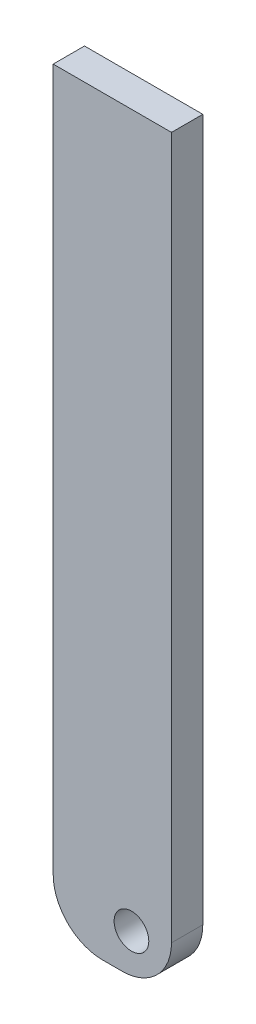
from build123d import *

# Parameters (mm, degrees)
SKETCH1_W           = 24
SKETCH1_H           = 152.4
SKETCH1_R           = 3.5179
BOSS_EXTRUDE1_DEPTH = 6.35
FILLET1_R           = 10


with BuildPart() as part:
    # Sketch1 → Boss-Extrude1 (new body)
    with BuildSketch(Plane.XY):
        with Locations((-3.875, 68.2)):
            Rectangle(SKETCH1_W, SKETCH1_H)
        Circle(SKETCH1_R, mode=Mode.SUBTRACT)
    extrude(amount=BOSS_EXTRUDE1_DEPTH)

    # Fillet1
    fillet1_edges = [part.edges().sort_by_distance(p)[0] for p in [
        (8.125, -8, 3.175),
        (-15.875, -8, 3.175),
    ]]
    fillet(fillet1_edges, radius=FILLET1_R)


solid = part.part
